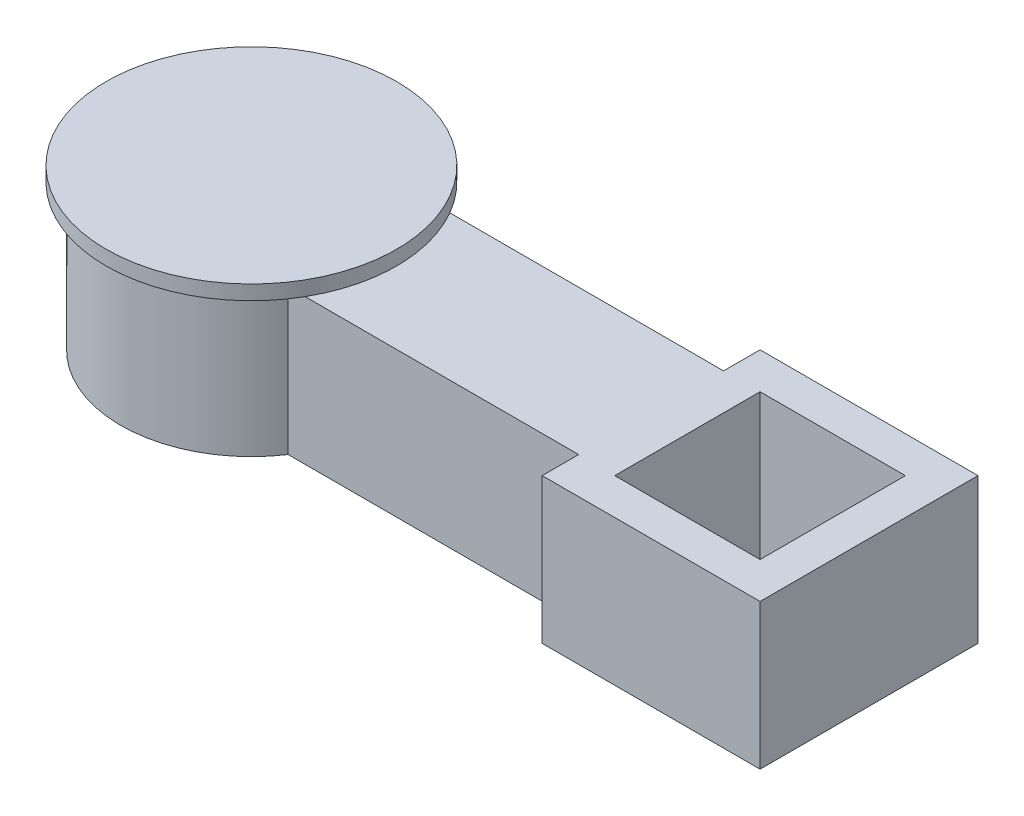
from build123d import *

# Parameters (mm, degrees)
SKETCH1_W           = 150
SKETCH1_H           = 150
BOSS_EXTRUDE1_DEPTH = 100
SKETCH5_R           = 70
CUT_EXTRUDE2_DEPTH  = 100
SKETCH6_R           = 100
BOSS_EXTRUDE4_DEPTH = 10
SKETCH7_W           = 100
SKETCH7_H           = 100
CUT_EXTRUDE3_DEPTH  = 100


with BuildPart() as part:
    # Sketch1 → Boss-Extrude1 (new body)
    with BuildSketch(Plane(origin=(0, 0, 0), x_dir=(1, 0, 0), z_dir=(0, 1, 0))):
        with BuildLine():
            Line((363.145565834, 275.992438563), (363.145565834, 275.741810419))
            ThreePointArc((363.145565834, 275.741810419), (198.145565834, 225.992438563), (363.145565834, 176.243066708))
            Line((363.145565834, 176.243066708), (563.145565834, 176.243066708))
            Line((563.145565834, 176.243066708), (563.145565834, 275.741810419))
            Line((563.145565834, 275.741810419), (563.145565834, 275.992438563))
            Line((563.145565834, 275.992438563), (363.145565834, 275.992438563))
        make_face()
        with Locations((638.145565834, 226.117752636)):
            Rectangle(SKETCH1_W, SKETCH1_H)
    extrude(amount=BOSS_EXTRUDE1_DEPTH)

    # Sketch5 → Cut-Extrude2 (cut)
    with BuildSketch(Plane(origin=(0, 100, 0), x_dir=(1, 0, 0), z_dir=(0, 1, 0))):
        with Locations(Location((288.145565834, 225.992438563, 0), (0, 0, 270))):
            Circle(SKETCH5_R)
    extrude(amount=-CUT_EXTRUDE2_DEPTH, mode=Mode.SUBTRACT)

    # Sketch6 → Boss-Extrude4 (add)
    with BuildSketch(Plane(origin=(0, 100, 0), x_dir=(1, 0, 0), z_dir=(0, 1, 0))):
        with Locations(Location((288.145565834, 225.992438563, 0), (0, 0, 30))):
            Circle(SKETCH6_R)
    extrude(amount=BOSS_EXTRUDE4_DEPTH)

    # Sketch7 → Cut-Extrude3 (cut)
    with BuildSketch(Plane(origin=(0, 100, 0), x_dir=(1, 0, 0), z_dir=(0, 1, 0))):
        with Locations((638.145565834, 226.117752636)):
            Rectangle(SKETCH7_W, SKETCH7_H)
    extrude(amount=-CUT_EXTRUDE3_DEPTH, mode=Mode.SUBTRACT)


solid = part.part
